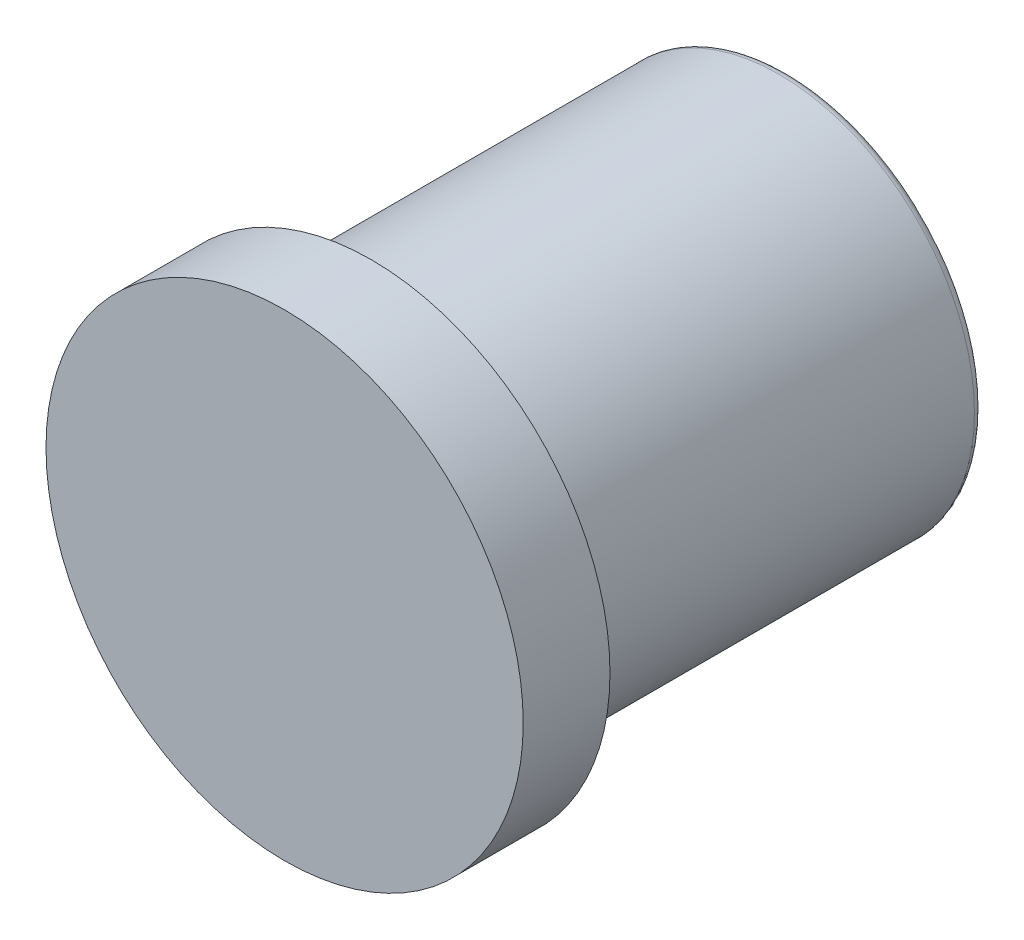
ISO-10303-21;
HEADER;
FILE_DESCRIPTION(('STEP AP214'),'2;1');
FILE_NAME('part.step','',(''),(''),'','','');
FILE_SCHEMA(('AUTOMOTIVE_DESIGN { 1 0 10303 214 1 1 1 1 }'));
ENDSEC;
DATA;
#1=APPLICATION_CONTEXT('core data for automotive mechanical design processes');
#2=APPLICATION_PROTOCOL_DEFINITION('international standard','automotive_design',2000,#1);
#3=PRODUCT_CONTEXT('',#1,'mechanical');
#4=PRODUCT('Part','Part','',(#3));
#5=PRODUCT_RELATED_PRODUCT_CATEGORY('part','',(#4));
#6=PRODUCT_DEFINITION_FORMATION('','',#4);
#7=PRODUCT_DEFINITION_CONTEXT('part definition',#1,'design');
#8=PRODUCT_DEFINITION('design','',#6,#7);
#9=PRODUCT_DEFINITION_SHAPE('','',#8);
#10=(LENGTH_UNIT() NAMED_UNIT(*) SI_UNIT(.MILLI.,.METRE.));
#11=(NAMED_UNIT(*) PLANE_ANGLE_UNIT() SI_UNIT($,.RADIAN.));
#12=(NAMED_UNIT(*) SI_UNIT($,.STERADIAN.) SOLID_ANGLE_UNIT());
#13=UNCERTAINTY_MEASURE_WITH_UNIT(LENGTH_MEASURE(1.E-05),#10,'distance_accuracy_value','');
#14=(GEOMETRIC_REPRESENTATION_CONTEXT(3) GLOBAL_UNCERTAINTY_ASSIGNED_CONTEXT((#13)) GLOBAL_UNIT_ASSIGNED_CONTEXT((#10,
#11,#12)) REPRESENTATION_CONTEXT('',''));
#15=CARTESIAN_POINT('',(0.,0.,0.));
#16=DIRECTION('',(0.,0.,1.));
#17=DIRECTION('',(1.,0.,0.));
#18=AXIS2_PLACEMENT_3D('',#15,#16,#17);
#19=CARTESIAN_POINT('',(0.,0.,-58.));
#20=DIRECTION('',(0.,0.,1.));
#21=DIRECTION('',(1.,0.,0.));
#22=AXIS2_PLACEMENT_3D('',#19,#20,#21);
#23=PLANE('',#22);
#24=CARTESIAN_POINT('',(0.,0.,-58.));
#25=DIRECTION('',(0.,0.,-1.));
#26=DIRECTION('',(-1.,0.,0.));
#27=AXIS2_PLACEMENT_3D('',#24,#25,#26);
#28=CIRCLE('',#27,4.025);
#29=CARTESIAN_POINT('',(-4.025,0.,-58.));
#30=VERTEX_POINT('',#29);
#31=EDGE_CURVE('E60',#30,#30,#28,.T.);
#32=ORIENTED_EDGE('',*,*,#31,.F.);
#33=EDGE_LOOP('',(#32));
#34=FACE_BOUND('',#33,.T.);
#35=CARTESIAN_POINT('',(0.,0.,-58.));
#36=DIRECTION('',(0.,0.,1.));
#37=DIRECTION('',(1.,0.,0.));
#38=AXIS2_PLACEMENT_3D('',#35,#36,#37);
#39=CIRCLE('',#38,21.5);
#40=CARTESIAN_POINT('',(21.5,0.,-58.));
#41=VERTEX_POINT('',#40);
#42=EDGE_CURVE('E11',#41,#41,#39,.T.);
#43=ORIENTED_EDGE('',*,*,#42,.F.);
#44=EDGE_LOOP('',(#43));
#45=FACE_BOUND('',#44,.T.);
#46=ADVANCED_FACE('F34',(#34,#45),#23,.F.);
#47=CARTESIAN_POINT('',(0.,0.,-57.));
#48=DIRECTION('',(0.,0.,1.));
#49=DIRECTION('',(1.,0.,0.));
#50=AXIS2_PLACEMENT_3D('',#47,#48,#49);
#51=TOROIDAL_SURFACE('',#50,21.5,1.);
#52=CARTESIAN_POINT('',(0.,0.,-57.));
#53=DIRECTION('',(0.,0.,1.));
#54=DIRECTION('',(1.,0.,0.));
#55=AXIS2_PLACEMENT_3D('',#52,#53,#54);
#56=CIRCLE('',#55,22.5);
#57=CARTESIAN_POINT('',(22.5,0.,-57.));
#58=VERTEX_POINT('',#57);
#59=EDGE_CURVE('E40',#58,#58,#56,.T.);
#60=ORIENTED_EDGE('',*,*,#59,.F.);
#61=EDGE_LOOP('',(#60));
#62=FACE_BOUND('',#61,.T.);
#63=ORIENTED_EDGE('',*,*,#42,.T.);
#64=EDGE_LOOP('',(#63));
#65=FACE_BOUND('',#64,.T.);
#66=ADVANCED_FACE('F73',(#62,#65),#51,.T.);
#67=CARTESIAN_POINT('',(0.,0.,0.));
#68=DIRECTION('',(0.,0.,1.));
#69=DIRECTION('',(1.,0.,0.));
#70=AXIS2_PLACEMENT_3D('',#67,#68,#69);
#71=CYLINDRICAL_SURFACE('',#70,22.5);
#72=CARTESIAN_POINT('',(0.,0.,-9.99999999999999));
#73=DIRECTION('',(0.,0.,1.));
#74=DIRECTION('',(1.,0.,0.));
#75=AXIS2_PLACEMENT_3D('',#72,#73,#74);
#76=CIRCLE('',#75,22.5);
#77=CARTESIAN_POINT('',(22.5,0.,-9.99999999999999));
#78=VERTEX_POINT('',#77);
#79=EDGE_CURVE('E66',#78,#78,#76,.T.);
#80=ORIENTED_EDGE('',*,*,#79,.F.);
#81=EDGE_LOOP('',(#80));
#82=FACE_BOUND('',#81,.T.);
#83=ORIENTED_EDGE('',*,*,#59,.T.);
#84=EDGE_LOOP('',(#83));
#85=FACE_BOUND('',#84,.T.);
#86=ADVANCED_FACE('F71',(#82,#85),#71,.T.);
#87=CARTESIAN_POINT('',(0.,22.5,-10.));
#88=DIRECTION('',(0.,0.,1.));
#89=DIRECTION('',(1.,0.,0.));
#90=AXIS2_PLACEMENT_3D('',#87,#88,#89);
#91=PLANE('',#90);
#92=CARTESIAN_POINT('',(0.,0.,-10.));
#93=DIRECTION('',(0.,0.,1.));
#94=DIRECTION('',(1.,0.,0.));
#95=AXIS2_PLACEMENT_3D('',#92,#93,#94);
#96=CIRCLE('',#95,27.5);
#97=CARTESIAN_POINT('',(27.5,0.,-10.));
#98=VERTEX_POINT('',#97);
#99=EDGE_CURVE('E57',#98,#98,#96,.T.);
#100=ORIENTED_EDGE('',*,*,#99,.F.);
#101=EDGE_LOOP('',(#100));
#102=FACE_BOUND('',#101,.T.);
#103=ORIENTED_EDGE('',*,*,#79,.T.);
#104=EDGE_LOOP('',(#103));
#105=FACE_BOUND('',#104,.T.);
#106=ADVANCED_FACE('F101',(#102,#105),#91,.F.);
#107=CARTESIAN_POINT('',(0.,0.,0.));
#108=DIRECTION('',(0.,0.,1.));
#109=DIRECTION('',(1.,0.,0.));
#110=AXIS2_PLACEMENT_3D('',#107,#108,#109);
#111=CYLINDRICAL_SURFACE('',#110,27.5);
#112=CARTESIAN_POINT('',(0.,0.,0.));
#113=DIRECTION('',(0.,0.,1.));
#114=DIRECTION('',(1.,0.,0.));
#115=AXIS2_PLACEMENT_3D('',#112,#113,#114);
#116=CIRCLE('',#115,27.5);
#117=CARTESIAN_POINT('',(27.5,0.,0.));
#118=VERTEX_POINT('',#117);
#119=EDGE_CURVE('E53',#118,#118,#116,.T.);
#120=ORIENTED_EDGE('',*,*,#119,.F.);
#121=EDGE_LOOP('',(#120));
#122=FACE_BOUND('',#121,.T.);
#123=ORIENTED_EDGE('',*,*,#99,.T.);
#124=EDGE_LOOP('',(#123));
#125=FACE_BOUND('',#124,.T.);
#126=ADVANCED_FACE('F97',(#122,#125),#111,.T.);
#127=CARTESIAN_POINT('',(0.,27.5,0.));
#128=DIRECTION('',(0.,0.,-1.));
#129=DIRECTION('',(-1.,0.,0.));
#130=AXIS2_PLACEMENT_3D('',#127,#128,#129);
#131=PLANE('',#130);
#132=ORIENTED_EDGE('',*,*,#119,.T.);
#133=EDGE_LOOP('',(#132));
#134=FACE_BOUND('',#133,.T.);
#135=ADVANCED_FACE('F47',(#134),#131,.F.);
#136=CARTESIAN_POINT('',(0.,0.,-46.25));
#137=DIRECTION('',(0.,0.,-1.));
#138=DIRECTION('',(-1.,0.,0.));
#139=AXIS2_PLACEMENT_3D('',#136,#137,#138);
#140=CONICAL_SURFACE('',#139,3.4,1.02974425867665);
#141=CARTESIAN_POINT('',(0.,0.,-44.2070738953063));
#142=VERTEX_POINT('',#141);
#143=VERTEX_LOOP('',#142);
#144=FACE_BOUND('',#143,.T.);
#145=CARTESIAN_POINT('',(0.,0.,-46.25));
#146=DIRECTION('',(0.,0.,-1.));
#147=DIRECTION('',(-1.,0.,0.));
#148=AXIS2_PLACEMENT_3D('',#145,#146,#147);
#149=CIRCLE('',#148,3.4);
#150=CARTESIAN_POINT('',(-3.4,0.,-46.25));
#151=VERTEX_POINT('',#150);
#152=EDGE_CURVE('E51',#151,#151,#149,.T.);
#153=ORIENTED_EDGE('',*,*,#152,.T.);
#154=EDGE_LOOP('',(#153));
#155=FACE_BOUND('',#154,.T.);
#156=ADVANCED_FACE('F43',(#144,#155),#140,.F.);
#157=CARTESIAN_POINT('',(0.,0.,-58.));
#158=DIRECTION('',(0.,0.,-1.));
#159=DIRECTION('',(-1.,0.,0.));
#160=AXIS2_PLACEMENT_3D('',#157,#158,#159);
#161=CYLINDRICAL_SURFACE('',#160,3.4);
#162=ORIENTED_EDGE('',*,*,#152,.F.);
#163=EDGE_LOOP('',(#162));
#164=FACE_BOUND('',#163,.T.);
#165=CARTESIAN_POINT('',(0.,0.,-57.375));
#166=DIRECTION('',(0.,0.,-1.));
#167=DIRECTION('',(-1.,0.,0.));
#168=AXIS2_PLACEMENT_3D('',#165,#166,#167);
#169=CIRCLE('',#168,3.4);
#170=CARTESIAN_POINT('',(-3.4,0.,-57.375));
#171=VERTEX_POINT('',#170);
#172=EDGE_CURVE('E54',#171,#171,#169,.T.);
#173=ORIENTED_EDGE('',*,*,#172,.T.);
#174=EDGE_LOOP('',(#173));
#175=FACE_BOUND('',#174,.T.);
#176=ADVANCED_FACE('F46',(#164,#175),#161,.F.);
#177=CARTESIAN_POINT('',(0.,0.,-58.));
#178=DIRECTION('',(0.,0.,-1.));
#179=DIRECTION('',(-1.,0.,0.));
#180=AXIS2_PLACEMENT_3D('',#177,#178,#179);
#181=CONICAL_SURFACE('',#180,4.025,0.785398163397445);
#182=ORIENTED_EDGE('',*,*,#172,.F.);
#183=EDGE_LOOP('',(#182));
#184=FACE_BOUND('',#183,.T.);
#185=ORIENTED_EDGE('',*,*,#31,.T.);
#186=EDGE_LOOP('',(#185));
#187=FACE_BOUND('',#186,.T.);
#188=ADVANCED_FACE('F85',(#184,#187),#181,.F.);
#189=CLOSED_SHELL('',(#46,#66,#86,#106,#126,#135,#156,#176,#188));
#190=MANIFOLD_SOLID_BREP('B2',#189);
#191=ADVANCED_BREP_SHAPE_REPRESENTATION('',(#18,#190),#14);
#192=SHAPE_DEFINITION_REPRESENTATION(#9,#191);
ENDSEC;
END-ISO-10303-21;
